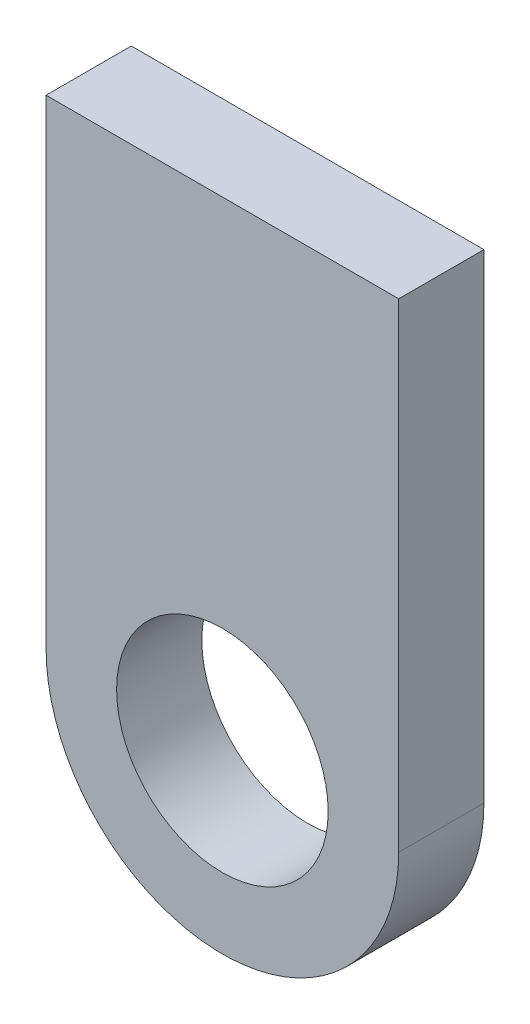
from build123d import *

# Parameters (mm, degrees)
ESQUISSE1_R      = 36
EXTRUSION1_DEPTH = 29


with BuildPart() as part:
    # Esquisse1 → Extrusion1 (new body)
    with BuildSketch(Plane.XY):
        with BuildLine():
            Line((-60, 0), (-60, 163.100482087))
            Line((-60, 163.100482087), (60, 163.100482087))
            Line((60, 163.100482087), (60, 0))
            ThreePointArc((60, 0), (0, -60), (-60, 0))
        make_face()
        with Locations(Location((0, 0, 0), (0, 0, 180))):
            Circle(ESQUISSE1_R, mode=Mode.SUBTRACT)
    extrude(amount=EXTRUSION1_DEPTH)


solid = part.part
